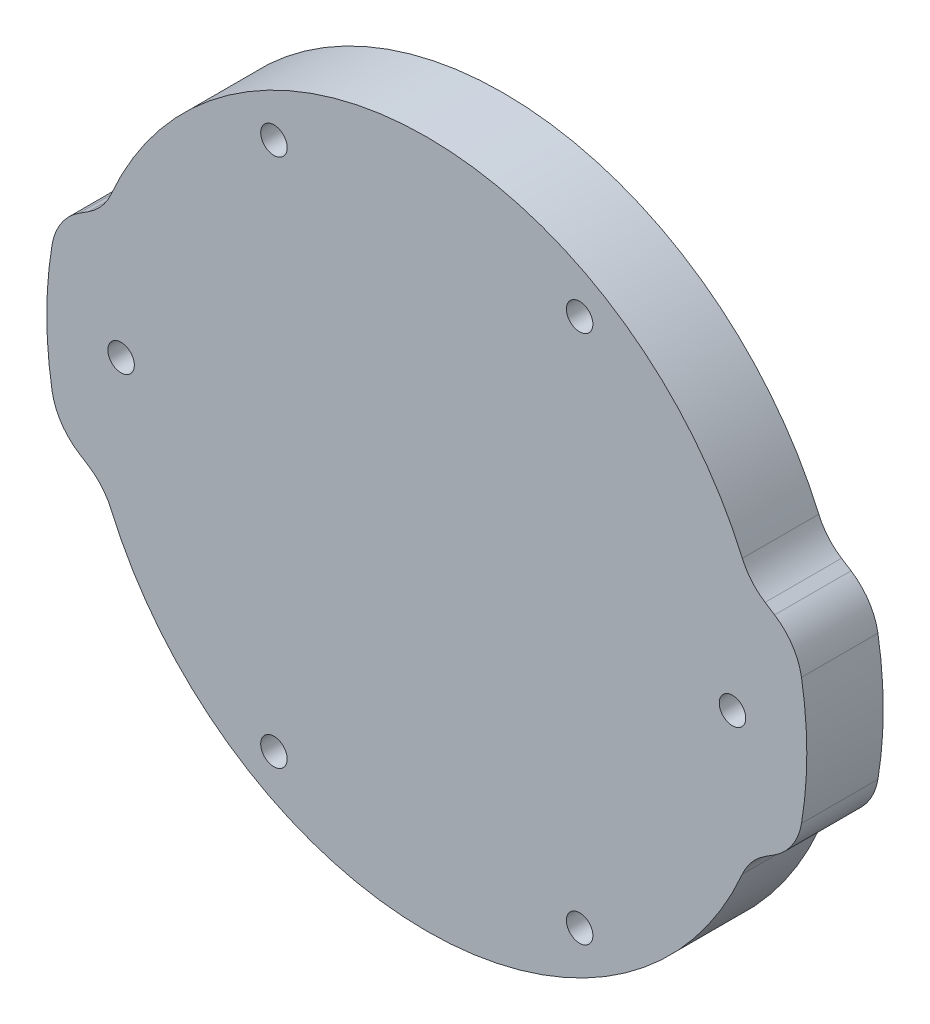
from build123d import *

# Parameters (mm, degrees)
SKETCH1_R           = 1.1
BOSS_EXTRUDE1_DEPTH = 6.35
FILLET1_R           = 5


with BuildPart() as part:
    # Sketch1 → Boss-Extrude1 (new body)
    with BuildSketch(Plane.XY):
        with BuildLine():
            Line((-30.671332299, 7.5), (-26.768089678, 10))
            ThreePointArc((-26.768089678, 10), (0, 28.575), (26.768089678, 10))
            Line((26.768089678, 10), (30.671332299, 7.5))
            ThreePointArc((30.671332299, 7.5), (31.575, 0), (30.671332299, -7.5))
            Line((30.671332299, -7.5), (26.768089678, -10))
            ThreePointArc((26.768089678, -10), (0, -28.575), (-26.768089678, -10))
            Line((-26.768089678, -10), (-30.671332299, -7.5))
            ThreePointArc((-30.671332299, -7.5), (-31.575, 0), (-30.671332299, 7.5))
        make_face()
        with Locations((-25.4, 0)):
            Circle(SKETCH1_R, mode=Mode.SUBTRACT)
        with Locations((-12.7, 21.997045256)):
            Circle(SKETCH1_R, mode=Mode.SUBTRACT)
        with Locations((12.7, 21.997045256)):
            Circle(SKETCH1_R, mode=Mode.SUBTRACT)
        with Locations((25.4, 0)):
            Circle(SKETCH1_R, mode=Mode.SUBTRACT)
        with Locations((12.7, -21.997045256)):
            Circle(SKETCH1_R, mode=Mode.SUBTRACT)
        with Locations((-12.7, -21.997045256)):
            Circle(SKETCH1_R, mode=Mode.SUBTRACT)
    extrude(amount=BOSS_EXTRUDE1_DEPTH)

    # Fillet1
    fillet1_edges = [part.edges().sort_by_distance(p)[0] for p in [
        (30.671332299, -7.5, 3.175),
        (26.768089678, -10, 3.175),
        (-26.768089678, -10, 3.175),
        (-30.671332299, -7.5, 3.175),
        (-30.671332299, 7.5, 3.175),
        (-26.768089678, 10, 3.175),
        (26.768089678, 10, 3.175),
        (30.671332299, 7.5, 3.175),
    ]]
    fillet(fillet1_edges, radius=FILLET1_R)


solid = part.part
